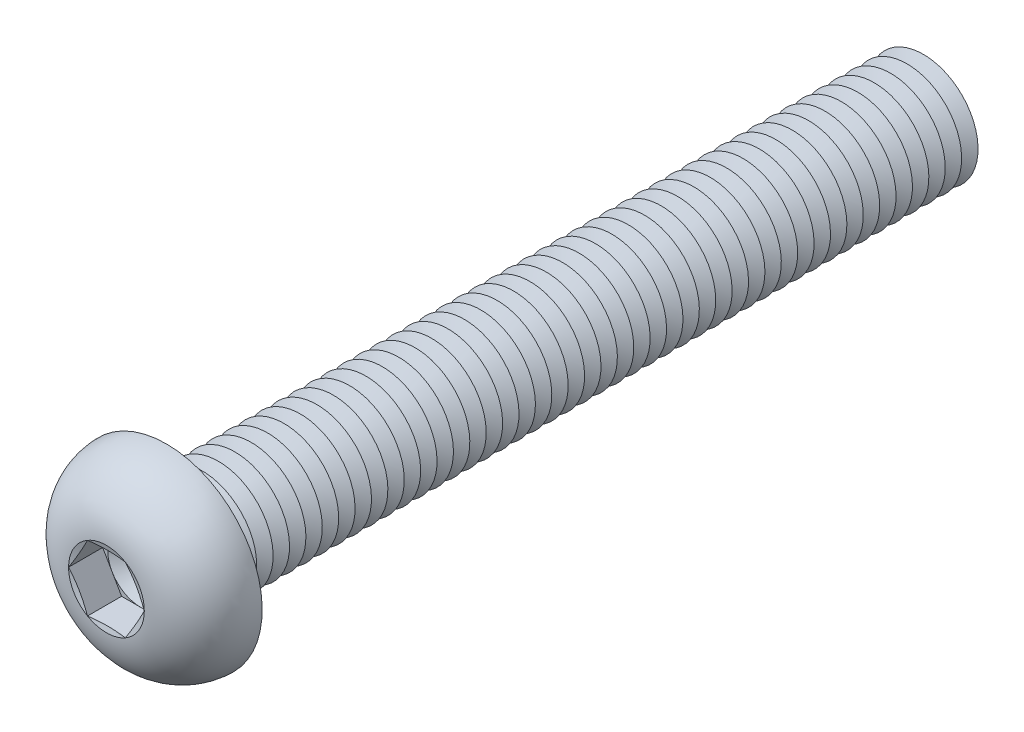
from build123d import *

# Parameters (mm, degrees)
FILLET1_R          = 0.75
LPATTERN1_COUNT    = 46
LPATTERN1_PITCH    = 1.5
CUT_EXTRUDE1_DEPTH = 3.12


with BuildPart() as part:
    # Sketch1 → Revolve1 (revolve)
    with BuildSketch(Plane(origin=(0, 0, 0), x_dir=(0, 0, -1), z_dir=(1, 0, 0))):
        with BuildLine():
            Line((0, 5), (0, 8.75))
            ThreePointArc((0, 8.75), (-3.814142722, 7.21429474), (-5.5, 3.4641))
            Line((-5.5, 3.4641), (-5.035898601, 1.73205))
            Line((-5.035898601, 1.73205), (-5.5, 1.73205))
            Line((-5.5, 1.73205), (-5.5, 0))
            Line((-5.5, 0), (70, 0))
            Line((70, 0), (70, 5))
            Line((70, 5), (0, 5))
        make_face()
    revolve(axis=Axis((0, 0, -70), (0, 0, 1)))

    # Fillet1
    fillet1_edges = [part.edges().sort_by_distance(p)[0] for p in [
        (0, -5, 0),
    ]]
    fillet(fillet1_edges, radius=FILLET1_R)

    # Sketch2 → Cut-Revolve1 (revolve, cut)
    with BuildSketch(Plane(origin=(0, 0, 0), x_dir=(0, 0, -1), z_dir=(1, 0, 0))):
        Polygon((69.25, 5), (70.75, 5), (70, 3.700961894), align=None)
    cut_revolve1 = revolve(axis=Axis((0, 0, -70), (0, 0, -1)), mode=Mode.SUBTRACT)

    # LPattern1: Cut-Revolve1 ×46
    with Locations(*[(0, 0, i * LPATTERN1_PITCH) for i in range(1, LPATTERN1_COUNT)]):
        add(cut_revolve1, mode=Mode.SUBTRACT)

    # Sketch3 → Cut-Extrude1 (cut)
    with BuildSketch(Plane.XY.offset(5.5)):
        Polygon((1.73205, 2.999998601), (-1.73205, 2.999998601), (-3.4641, 0), (-1.73205, -2.999998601), (1.73205, -2.999998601), (3.4641, 0), align=None)
    extrude(amount=-CUT_EXTRUDE1_DEPTH, mode=Mode.SUBTRACT)

    # Cut-Extrude2 cone 1 section (on through the dimple's axis) → Cut-Extrude2 (revolve, cut)
    with BuildSketch(Plane(origin=(0, 0, 2.38), x_dir=(0, -1, 0), z_dir=(1, 0, 0))):
        Polygon((0, 0), (2.999998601, 0), (0, 1.73205), align=None)
    revolve(axis=Axis((0, 0, 2.38), (0, 0, -1)), mode=Mode.SUBTRACT)


solid = part.part
